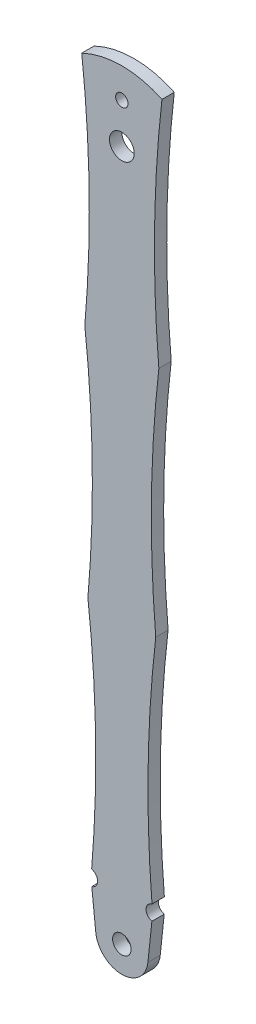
ISO-10303-21;
HEADER;
FILE_DESCRIPTION(('STEP AP214'),'2;1');
FILE_NAME('part.step','',(''),(''),'','','');
FILE_SCHEMA(('AUTOMOTIVE_DESIGN { 1 0 10303 214 1 1 1 1 }'));
ENDSEC;
DATA;
#1=APPLICATION_CONTEXT('core data for automotive mechanical design processes');
#2=APPLICATION_PROTOCOL_DEFINITION('international standard','automotive_design',2000,#1);
#3=PRODUCT_CONTEXT('',#1,'mechanical');
#4=PRODUCT('Part','Part','',(#3));
#5=PRODUCT_RELATED_PRODUCT_CATEGORY('part','',(#4));
#6=PRODUCT_DEFINITION_FORMATION('','',#4);
#7=PRODUCT_DEFINITION_CONTEXT('part definition',#1,'design');
#8=PRODUCT_DEFINITION('design','',#6,#7);
#9=PRODUCT_DEFINITION_SHAPE('','',#8);
#10=(LENGTH_UNIT() NAMED_UNIT(*) SI_UNIT(.MILLI.,.METRE.));
#11=(NAMED_UNIT(*) PLANE_ANGLE_UNIT() SI_UNIT($,.RADIAN.));
#12=(NAMED_UNIT(*) SI_UNIT($,.STERADIAN.) SOLID_ANGLE_UNIT());
#13=UNCERTAINTY_MEASURE_WITH_UNIT(LENGTH_MEASURE(1.E-05),#10,'distance_accuracy_value','');
#14=(GEOMETRIC_REPRESENTATION_CONTEXT(3) GLOBAL_UNCERTAINTY_ASSIGNED_CONTEXT((#13)) GLOBAL_UNIT_ASSIGNED_CONTEXT((#10,
#11,#12)) REPRESENTATION_CONTEXT('',''));
#15=CARTESIAN_POINT('',(0.,0.,0.));
#16=DIRECTION('',(0.,0.,1.));
#17=DIRECTION('',(1.,0.,0.));
#18=AXIS2_PLACEMENT_3D('',#15,#16,#17);
#19=CARTESIAN_POINT('',(-10.8900369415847,111.423525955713,2.));
#20=DIRECTION('',(0.,0.,-1.));
#21=DIRECTION('',(-1.,0.,0.));
#22=AXIS2_PLACEMENT_3D('',#19,#20,#21);
#23=CYLINDRICAL_SURFACE('',#22,15.);
#24=CARTESIAN_POINT('',(-10.8900369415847,111.423525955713,0.));
#25=DIRECTION('',(0.,0.,1.));
#26=DIRECTION('',(1.,0.,0.));
#27=AXIS2_PLACEMENT_3D('',#24,#25,#26);
#28=CIRCLE('',#27,15.);
#29=CARTESIAN_POINT('',(-4.39003694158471,124.942031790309,0.));
#30=VERTEX_POINT('',#29);
#31=CARTESIAN_POINT('',(-17.3900369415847,124.942031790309,0.));
#32=VERTEX_POINT('',#31);
#33=EDGE_CURVE('E191',#30,#32,#28,.T.);
#34=ORIENTED_EDGE('',*,*,#33,.T.);
#35=DIRECTION('',(0.,0.,-1.));
#36=VECTOR('',#35,1.);
#37=CARTESIAN_POINT('',(-17.3900369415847,124.942031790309,2.));
#38=LINE('',#37,#36);
#39=CARTESIAN_POINT('',(-17.3900369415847,124.942031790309,2.));
#40=VERTEX_POINT('',#39);
#41=EDGE_CURVE('E46',#40,#32,#38,.T.);
#42=ORIENTED_EDGE('',*,*,#41,.F.);
#43=CARTESIAN_POINT('',(-10.8900369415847,111.423525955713,2.));
#44=DIRECTION('',(0.,0.,1.));
#45=DIRECTION('',(1.,0.,0.));
#46=AXIS2_PLACEMENT_3D('',#43,#44,#45);
#47=CIRCLE('',#46,15.);
#48=CARTESIAN_POINT('',(-4.39003694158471,124.942031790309,2.));
#49=VERTEX_POINT('',#48);
#50=EDGE_CURVE('E160',#49,#40,#47,.T.);
#51=ORIENTED_EDGE('',*,*,#50,.F.);
#52=DIRECTION('',(0.,0.,-1.));
#53=VECTOR('',#52,1.);
#54=CARTESIAN_POINT('',(-4.39003694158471,124.942031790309,2.));
#55=LINE('',#54,#53);
#56=EDGE_CURVE('E161',#49,#30,#55,.T.);
#57=ORIENTED_EDGE('',*,*,#56,.T.);
#58=EDGE_LOOP('',(#34,#42,#51,#57));
#59=FACE_BOUND('',#58,.T.);
#60=ADVANCED_FACE('F39',(#59),#23,.T.);
#61=CARTESIAN_POINT('',(-206.171121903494,103.454780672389,2.));
#62=DIRECTION('',(0.,0.,-1.));
#63=DIRECTION('',(-1.,0.,0.));
#64=AXIS2_PLACEMENT_3D('',#61,#62,#63);
#65=CYLINDRICAL_SURFACE('',#64,190.);
#66=CARTESIAN_POINT('',(-206.171121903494,103.454780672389,0.));
#67=DIRECTION('',(0.,0.,1.));
#68=DIRECTION('',(1.,0.,0.));
#69=AXIS2_PLACEMENT_3D('',#66,#67,#68);
#70=CIRCLE('',#69,190.);
#71=CARTESIAN_POINT('',(-16.8900369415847,86.9420317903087,0.));
#72=VERTEX_POINT('',#71);
#73=EDGE_CURVE('E185',#32,#72,#70,.F.);
#74=ORIENTED_EDGE('',*,*,#73,.T.);
#75=DIRECTION('',(0.,0.,-1.));
#76=VECTOR('',#75,1.);
#77=CARTESIAN_POINT('',(-16.8900369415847,86.9420317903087,2.));
#78=LINE('',#77,#76);
#79=CARTESIAN_POINT('',(-16.8900369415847,86.9420317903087,2.));
#80=VERTEX_POINT('',#79);
#81=EDGE_CURVE('E177',#80,#72,#78,.T.);
#82=ORIENTED_EDGE('',*,*,#81,.F.);
#83=CARTESIAN_POINT('',(-206.171121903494,103.454780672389,2.));
#84=DIRECTION('',(0.,0.,1.));
#85=DIRECTION('',(1.,0.,0.));
#86=AXIS2_PLACEMENT_3D('',#83,#84,#85);
#87=CIRCLE('',#86,190.);
#88=EDGE_CURVE('E186',#40,#80,#87,.F.);
#89=ORIENTED_EDGE('',*,*,#88,.F.);
#90=ORIENTED_EDGE('',*,*,#41,.T.);
#91=EDGE_LOOP('',(#74,#82,#89,#90));
#92=FACE_BOUND('',#91,.T.);
#93=ADVANCED_FACE('F183',(#92),#65,.F.);
#94=CARTESIAN_POINT('',(-205.671121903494,65.4547806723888,2.));
#95=DIRECTION('',(0.,0.,-1.));
#96=DIRECTION('',(-1.,0.,0.));
#97=AXIS2_PLACEMENT_3D('',#94,#95,#96);
#98=CYLINDRICAL_SURFACE('',#97,190.);
#99=CARTESIAN_POINT('',(-205.671121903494,65.4547806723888,0.));
#100=DIRECTION('',(0.,0.,1.));
#101=DIRECTION('',(1.,0.,0.));
#102=AXIS2_PLACEMENT_3D('',#99,#100,#101);
#103=CIRCLE('',#102,190.);
#104=CARTESIAN_POINT('',(-16.3900369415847,48.9420317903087,0.));
#105=VERTEX_POINT('',#104);
#106=EDGE_CURVE('E194',#72,#105,#103,.F.);
#107=ORIENTED_EDGE('',*,*,#106,.T.);
#108=DIRECTION('',(0.,0.,-1.));
#109=VECTOR('',#108,1.);
#110=CARTESIAN_POINT('',(-16.3900369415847,48.9420317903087,2.));
#111=LINE('',#110,#109);
#112=CARTESIAN_POINT('',(-16.3900369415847,48.9420317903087,2.));
#113=VERTEX_POINT('',#112);
#114=EDGE_CURVE('E174',#113,#105,#111,.T.);
#115=ORIENTED_EDGE('',*,*,#114,.F.);
#116=CARTESIAN_POINT('',(-205.671121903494,65.4547806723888,2.));
#117=DIRECTION('',(0.,0.,1.));
#118=DIRECTION('',(1.,0.,0.));
#119=AXIS2_PLACEMENT_3D('',#116,#117,#118);
#120=CIRCLE('',#119,190.);
#121=EDGE_CURVE('E303',#80,#113,#120,.F.);
#122=ORIENTED_EDGE('',*,*,#121,.F.);
#123=ORIENTED_EDGE('',*,*,#81,.T.);
#124=EDGE_LOOP('',(#107,#115,#122,#123));
#125=FACE_BOUND('',#124,.T.);
#126=ADVANCED_FACE('F263',(#125),#98,.F.);
#127=CARTESIAN_POINT('',(-205.121034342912,27.0191984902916,2.));
#128=DIRECTION('',(0.,0.,-1.));
#129=DIRECTION('',(-1.,0.,0.));
#130=AXIS2_PLACEMENT_3D('',#127,#128,#129);
#131=CYLINDRICAL_SURFACE('',#130,190.);
#132=CARTESIAN_POINT('',(-205.121034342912,27.0191984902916,0.));
#133=DIRECTION('',(0.,0.,1.));
#134=DIRECTION('',(1.,0.,0.));
#135=AXIS2_PLACEMENT_3D('',#132,#133,#134);
#136=CIRCLE('',#135,190.);
#137=CARTESIAN_POINT('',(-15.7829406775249,11.1734960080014,0.));
#138=VERTEX_POINT('',#137);
#139=EDGE_CURVE('E202',#105,#138,#136,.F.);
#140=ORIENTED_EDGE('',*,*,#139,.T.);
#141=DIRECTION('',(0.,0.,1.));
#142=VECTOR('',#141,1.);
#143=CARTESIAN_POINT('',(-15.7829406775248,11.1734960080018,1.));
#144=LINE('',#143,#142);
#145=CARTESIAN_POINT('',(-15.7829406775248,11.1734960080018,2.));
#146=VERTEX_POINT('',#145);
#147=EDGE_CURVE('E61',#138,#146,#144,.T.);
#148=ORIENTED_EDGE('',*,*,#147,.T.);
#149=CARTESIAN_POINT('',(-205.121034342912,27.0191984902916,2.));
#150=DIRECTION('',(0.,0.,1.));
#151=DIRECTION('',(1.,0.,0.));
#152=AXIS2_PLACEMENT_3D('',#149,#150,#151);
#153=CIRCLE('',#152,190.);
#154=EDGE_CURVE('E228',#113,#146,#153,.F.);
#155=ORIENTED_EDGE('',*,*,#154,.F.);
#156=ORIENTED_EDGE('',*,*,#114,.T.);
#157=EDGE_LOOP('',(#140,#148,#155,#156));
#158=FACE_BOUND('',#157,.T.);
#159=ADVANCED_FACE('F267',(#158),#131,.F.);
#160=CARTESIAN_POINT('',(-14.6720017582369,-1.554473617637,2.));
#161=DIRECTION('',(0.994434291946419,0.105358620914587,0.));
#162=DIRECTION('',(-0.105358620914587,0.99443429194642,0.));
#163=AXIS2_PLACEMENT_3D('',#160,#161,#162);
#164=PLANE('',#163);
#165=DIRECTION('',(0.105358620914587,-0.99443429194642,0.));
#166=VECTOR('',#165,1.);
#167=CARTESIAN_POINT('',(-14.6720017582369,-1.554473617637,2.));
#168=LINE('',#167,#166);
#169=CARTESIAN_POINT('',(-15.7630093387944,8.74307338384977,2.));
#170=VERTEX_POINT('',#169);
#171=CARTESIAN_POINT('',(-15.116382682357,2.63984504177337,2.));
#172=VERTEX_POINT('',#171);
#173=EDGE_CURVE('E226',#170,#172,#168,.T.);
#174=ORIENTED_EDGE('',*,*,#173,.F.);
#175=DIRECTION('',(0.,0.,1.));
#176=VECTOR('',#175,1.);
#177=CARTESIAN_POINT('',(-15.7630093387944,8.74307338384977,0.));
#178=LINE('',#177,#176);
#179=CARTESIAN_POINT('',(-15.7630093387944,8.74307338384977,0.));
#180=VERTEX_POINT('',#179);
#181=EDGE_CURVE('E196',#170,#180,#178,.F.);
#182=ORIENTED_EDGE('',*,*,#181,.T.);
#183=DIRECTION('',(0.105358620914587,-0.99443429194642,0.));
#184=VECTOR('',#183,1.);
#185=CARTESIAN_POINT('',(-14.6720017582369,-1.554473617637,0.));
#186=LINE('',#185,#184);
#187=CARTESIAN_POINT('',(-15.116382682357,2.63984504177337,0.));
#188=VERTEX_POINT('',#187);
#189=EDGE_CURVE('E205',#180,#188,#186,.T.);
#190=ORIENTED_EDGE('',*,*,#189,.T.);
#191=DIRECTION('',(0.,0.,-1.));
#192=VECTOR('',#191,1.);
#193=CARTESIAN_POINT('',(-15.116382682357,2.63984504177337,2.));
#194=LINE('',#193,#192);
#195=EDGE_CURVE('E171',#172,#188,#194,.T.);
#196=ORIENTED_EDGE('',*,*,#195,.F.);
#197=EDGE_LOOP('',(#174,#182,#190,#196));
#198=FACE_BOUND('',#197,.T.);
#199=ADVANCED_FACE('F273',(#198),#164,.F.);
#200=CARTESIAN_POINT('',(-10.8900369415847,3.08761918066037,2.));
#201=DIRECTION('',(0.,0.,-1.));
#202=DIRECTION('',(-1.,0.,0.));
#203=AXIS2_PLACEMENT_3D('',#200,#201,#202);
#204=CYLINDRICAL_SURFACE('',#203,4.25);
#205=CARTESIAN_POINT('',(-10.8900369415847,3.08761918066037,0.));
#206=DIRECTION('',(0.,0.,1.));
#207=DIRECTION('',(1.,0.,0.));
#208=AXIS2_PLACEMENT_3D('',#205,#206,#207);
#209=CIRCLE('',#208,4.25);
#210=CARTESIAN_POINT('',(-6.6636912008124,2.63984504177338,0.));
#211=VERTEX_POINT('',#210);
#212=EDGE_CURVE('E152',#188,#211,#209,.T.);
#213=ORIENTED_EDGE('',*,*,#212,.T.);
#214=DIRECTION('',(0.,0.,-1.));
#215=VECTOR('',#214,1.);
#216=CARTESIAN_POINT('',(-6.6636912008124,2.63984504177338,2.));
#217=LINE('',#216,#215);
#218=CARTESIAN_POINT('',(-6.6636912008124,2.63984504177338,2.));
#219=VERTEX_POINT('',#218);
#220=EDGE_CURVE('E168',#219,#211,#217,.T.);
#221=ORIENTED_EDGE('',*,*,#220,.F.);
#222=CARTESIAN_POINT('',(-10.8900369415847,3.08761918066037,2.));
#223=DIRECTION('',(0.,0.,1.));
#224=DIRECTION('',(1.,0.,0.));
#225=AXIS2_PLACEMENT_3D('',#222,#223,#224);
#226=CIRCLE('',#225,4.25);
#227=EDGE_CURVE('E220',#172,#219,#226,.T.);
#228=ORIENTED_EDGE('',*,*,#227,.F.);
#229=ORIENTED_EDGE('',*,*,#195,.T.);
#230=EDGE_LOOP('',(#213,#221,#228,#229));
#231=FACE_BOUND('',#230,.T.);
#232=ADVANCED_FACE('F210',(#231),#204,.T.);
#233=CARTESIAN_POINT('',(-6.86630374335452,0.72747319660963,2.));
#234=DIRECTION('',(0.994434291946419,-0.105358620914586,0.));
#235=DIRECTION('',(0.105358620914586,0.99443429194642,0.));
#236=AXIS2_PLACEMENT_3D('',#233,#234,#235);
#237=PLANE('',#236);
#238=DIRECTION('',(0.,0.,1.));
#239=VECTOR('',#238,1.);
#240=CARTESIAN_POINT('',(-6.01706454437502,8.74307338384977,0.));
#241=LINE('',#240,#239);
#242=CARTESIAN_POINT('',(-6.01706454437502,8.74307338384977,2.));
#243=VERTEX_POINT('',#242);
#244=CARTESIAN_POINT('',(-6.01706454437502,8.74307338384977,0.));
#245=VERTEX_POINT('',#244);
#246=EDGE_CURVE('E53',#243,#245,#241,.F.);
#247=ORIENTED_EDGE('',*,*,#246,.F.);
#248=DIRECTION('',(-0.105358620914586,-0.99443429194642,0.));
#249=VECTOR('',#248,1.);
#250=CARTESIAN_POINT('',(-6.86630374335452,0.72747319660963,2.));
#251=LINE('',#250,#249);
#252=EDGE_CURVE('E217',#243,#219,#251,.T.);
#253=ORIENTED_EDGE('',*,*,#252,.T.);
#254=ORIENTED_EDGE('',*,*,#220,.T.);
#255=DIRECTION('',(-0.105358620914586,-0.99443429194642,0.));
#256=VECTOR('',#255,1.);
#257=CARTESIAN_POINT('',(-6.86630374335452,0.72747319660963,0.));
#258=LINE('',#257,#256);
#259=EDGE_CURVE('E148',#245,#211,#258,.T.);
#260=ORIENTED_EDGE('',*,*,#259,.F.);
#261=EDGE_LOOP('',(#247,#253,#254,#260));
#262=FACE_BOUND('',#261,.T.);
#263=ADVANCED_FACE('F215',(#262),#237,.T.);
#264=CARTESIAN_POINT('',(183.340960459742,27.0191984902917,2.));
#265=DIRECTION('',(0.,0.,-1.));
#266=DIRECTION('',(-1.,0.,0.));
#267=AXIS2_PLACEMENT_3D('',#264,#265,#266);
#268=CYLINDRICAL_SURFACE('',#267,190.);
#269=DIRECTION('',(0.,0.,1.));
#270=VECTOR('',#269,1.);
#271=CARTESIAN_POINT('',(-5.99713320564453,11.1734960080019,1.));
#272=LINE('',#271,#270);
#273=CARTESIAN_POINT('',(-5.99713320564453,11.1734960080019,0.));
#274=VERTEX_POINT('',#273);
#275=CARTESIAN_POINT('',(-5.99713320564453,11.1734960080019,2.));
#276=VERTEX_POINT('',#275);
#277=EDGE_CURVE('E126',#274,#276,#272,.T.);
#278=ORIENTED_EDGE('',*,*,#277,.F.);
#279=CARTESIAN_POINT('',(183.340960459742,27.0191984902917,0.));
#280=DIRECTION('',(0.,0.,1.));
#281=DIRECTION('',(1.,0.,0.));
#282=AXIS2_PLACEMENT_3D('',#279,#280,#281);
#283=CIRCLE('',#282,190.);
#284=CARTESIAN_POINT('',(-5.3900369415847,48.9420317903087,0.));
#285=VERTEX_POINT('',#284);
#286=EDGE_CURVE('E138',#285,#274,#283,.T.);
#287=ORIENTED_EDGE('',*,*,#286,.F.);
#288=DIRECTION('',(0.,0.,-1.));
#289=VECTOR('',#288,1.);
#290=CARTESIAN_POINT('',(-5.3900369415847,48.9420317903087,2.));
#291=LINE('',#290,#289);
#292=CARTESIAN_POINT('',(-5.3900369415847,48.9420317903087,2.));
#293=VERTEX_POINT('',#292);
#294=EDGE_CURVE('E166',#293,#285,#291,.T.);
#295=ORIENTED_EDGE('',*,*,#294,.F.);
#296=CARTESIAN_POINT('',(183.340960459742,27.0191984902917,2.));
#297=DIRECTION('',(0.,0.,1.));
#298=DIRECTION('',(1.,0.,0.));
#299=AXIS2_PLACEMENT_3D('',#296,#297,#298);
#300=CIRCLE('',#299,190.);
#301=EDGE_CURVE('E141',#293,#276,#300,.T.);
#302=ORIENTED_EDGE('',*,*,#301,.T.);
#303=EDGE_LOOP('',(#278,#287,#295,#302));
#304=FACE_BOUND('',#303,.T.);
#305=ADVANCED_FACE('F137',(#304),#268,.F.);
#306=CARTESIAN_POINT('',(183.891048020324,65.4547806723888,2.));
#307=DIRECTION('',(0.,0.,-1.));
#308=DIRECTION('',(-1.,0.,0.));
#309=AXIS2_PLACEMENT_3D('',#306,#307,#308);
#310=CYLINDRICAL_SURFACE('',#309,190.);
#311=CARTESIAN_POINT('',(183.891048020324,65.4547806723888,0.));
#312=DIRECTION('',(0.,0.,1.));
#313=DIRECTION('',(1.,0.,0.));
#314=AXIS2_PLACEMENT_3D('',#311,#312,#313);
#315=CIRCLE('',#314,190.);
#316=CARTESIAN_POINT('',(-4.89003694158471,86.9420317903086,0.));
#317=VERTEX_POINT('',#316);
#318=EDGE_CURVE('E147',#317,#285,#315,.T.);
#319=ORIENTED_EDGE('',*,*,#318,.F.);
#320=DIRECTION('',(0.,0.,-1.));
#321=VECTOR('',#320,1.);
#322=CARTESIAN_POINT('',(-4.89003694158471,86.9420317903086,2.));
#323=LINE('',#322,#321);
#324=CARTESIAN_POINT('',(-4.89003694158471,86.9420317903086,2.));
#325=VERTEX_POINT('',#324);
#326=EDGE_CURVE('E163',#325,#317,#323,.T.);
#327=ORIENTED_EDGE('',*,*,#326,.F.);
#328=CARTESIAN_POINT('',(183.891048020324,65.4547806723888,2.));
#329=DIRECTION('',(0.,0.,1.));
#330=DIRECTION('',(1.,0.,0.));
#331=AXIS2_PLACEMENT_3D('',#328,#329,#330);
#332=CIRCLE('',#331,190.);
#333=EDGE_CURVE('E233',#325,#293,#332,.T.);
#334=ORIENTED_EDGE('',*,*,#333,.T.);
#335=ORIENTED_EDGE('',*,*,#294,.T.);
#336=EDGE_LOOP('',(#319,#327,#334,#335));
#337=FACE_BOUND('',#336,.T.);
#338=ADVANCED_FACE('F284',(#337),#310,.F.);
#339=CARTESIAN_POINT('',(184.391048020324,103.454780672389,2.));
#340=DIRECTION('',(0.,0.,-1.));
#341=DIRECTION('',(-1.,0.,0.));
#342=AXIS2_PLACEMENT_3D('',#339,#340,#341);
#343=CYLINDRICAL_SURFACE('',#342,190.);
#344=CARTESIAN_POINT('',(184.391048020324,103.454780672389,0.));
#345=DIRECTION('',(0.,0.,1.));
#346=DIRECTION('',(1.,0.,0.));
#347=AXIS2_PLACEMENT_3D('',#344,#345,#346);
#348=CIRCLE('',#347,190.);
#349=EDGE_CURVE('E150',#30,#317,#348,.T.);
#350=ORIENTED_EDGE('',*,*,#349,.F.);
#351=ORIENTED_EDGE('',*,*,#56,.F.);
#352=CARTESIAN_POINT('',(184.391048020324,103.454780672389,2.));
#353=DIRECTION('',(0.,0.,1.));
#354=DIRECTION('',(1.,0.,0.));
#355=AXIS2_PLACEMENT_3D('',#352,#353,#354);
#356=CIRCLE('',#355,190.);
#357=EDGE_CURVE('E235',#49,#325,#356,.T.);
#358=ORIENTED_EDGE('',*,*,#357,.T.);
#359=ORIENTED_EDGE('',*,*,#326,.T.);
#360=EDGE_LOOP('',(#350,#351,#358,#359));
#361=FACE_BOUND('',#360,.T.);
#362=ADVANCED_FACE('F254',(#361),#343,.F.);
#363=CARTESIAN_POINT('',(-10.8900369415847,3.08761918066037,2.));
#364=DIRECTION('',(0.,0.,-1.));
#365=DIRECTION('',(-1.,0.,0.));
#366=AXIS2_PLACEMENT_3D('',#363,#364,#365);
#367=CYLINDRICAL_SURFACE('',#366,1.5);
#368=CARTESIAN_POINT('',(-10.8900369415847,3.08761918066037,2.));
#369=DIRECTION('',(0.,0.,1.));
#370=DIRECTION('',(1.,0.,0.));
#371=AXIS2_PLACEMENT_3D('',#368,#369,#370);
#372=CIRCLE('',#371,1.5);
#373=CARTESIAN_POINT('',(-9.39003694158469,3.08761918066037,2.));
#374=VERTEX_POINT('',#373);
#375=EDGE_CURVE('E164',#374,#374,#372,.T.);
#376=ORIENTED_EDGE('',*,*,#375,.T.);
#377=EDGE_LOOP('',(#376));
#378=FACE_BOUND('',#377,.T.);
#379=CARTESIAN_POINT('',(-10.8900369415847,3.08761918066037,0.));
#380=DIRECTION('',(0.,0.,1.));
#381=DIRECTION('',(1.,0.,0.));
#382=AXIS2_PLACEMENT_3D('',#379,#380,#381);
#383=CIRCLE('',#382,1.5);
#384=CARTESIAN_POINT('',(-9.39003694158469,3.08761918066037,0.));
#385=VERTEX_POINT('',#384);
#386=EDGE_CURVE('E157',#385,#385,#383,.T.);
#387=ORIENTED_EDGE('',*,*,#386,.F.);
#388=EDGE_LOOP('',(#387));
#389=FACE_BOUND('',#388,.T.);
#390=ADVANCED_FACE('F242',(#378,#389),#367,.F.);
#391=CARTESIAN_POINT('',(0.,0.,2.));
#392=DIRECTION('',(0.,0.,1.));
#393=DIRECTION('',(1.,0.,0.));
#394=AXIS2_PLACEMENT_3D('',#391,#392,#393);
#395=PLANE('',#394);
#396=CARTESIAN_POINT('',(-10.8900369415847,121.58761918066,2.));
#397=DIRECTION('',(0.,0.,1.));
#398=DIRECTION('',(1.,0.,0.));
#399=AXIS2_PLACEMENT_3D('',#396,#397,#398);
#400=CIRCLE('',#399,1.);
#401=CARTESIAN_POINT('',(-9.89003694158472,121.58761918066,2.));
#402=VERTEX_POINT('',#401);
#403=EDGE_CURVE('E330',#402,#402,#400,.T.);
#404=ORIENTED_EDGE('',*,*,#403,.F.);
#405=EDGE_LOOP('',(#404));
#406=FACE_BOUND('',#405,.T.);
#407=CARTESIAN_POINT('',(-10.8900369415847,115.08761918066,2.));
#408=DIRECTION('',(0.,0.,1.));
#409=DIRECTION('',(1.,0.,0.));
#410=AXIS2_PLACEMENT_3D('',#407,#408,#409);
#411=CIRCLE('',#410,2.);
#412=CARTESIAN_POINT('',(-8.89003694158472,115.08761918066,2.));
#413=VERTEX_POINT('',#412);
#414=EDGE_CURVE('E332',#413,#413,#411,.T.);
#415=ORIENTED_EDGE('',*,*,#414,.F.);
#416=EDGE_LOOP('',(#415));
#417=FACE_BOUND('',#416,.T.);
#418=CARTESIAN_POINT('',(-5.71442774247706,9.95588456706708,2.));
#419=DIRECTION('',(0.,0.,1.));
#420=DIRECTION('',(1.,0.,0.));
#421=AXIS2_PLACEMENT_3D('',#418,#419,#420);
#422=CIRCLE('',#421,1.25);
#423=EDGE_CURVE('E131',#276,#243,#422,.T.);
#424=ORIENTED_EDGE('',*,*,#423,.F.);
#425=ORIENTED_EDGE('',*,*,#301,.F.);
#426=ORIENTED_EDGE('',*,*,#333,.F.);
#427=ORIENTED_EDGE('',*,*,#357,.F.);
#428=ORIENTED_EDGE('',*,*,#50,.T.);
#429=ORIENTED_EDGE('',*,*,#88,.T.);
#430=ORIENTED_EDGE('',*,*,#121,.T.);
#431=ORIENTED_EDGE('',*,*,#154,.T.);
#432=CARTESIAN_POINT('',(-16.0656461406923,9.95588456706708,2.));
#433=DIRECTION('',(0.,0.,1.));
#434=DIRECTION('',(1.,0.,0.));
#435=AXIS2_PLACEMENT_3D('',#432,#433,#434);
#436=CIRCLE('',#435,1.25);
#437=EDGE_CURVE('E297',#170,#146,#436,.T.);
#438=ORIENTED_EDGE('',*,*,#437,.F.);
#439=ORIENTED_EDGE('',*,*,#173,.T.);
#440=ORIENTED_EDGE('',*,*,#227,.T.);
#441=ORIENTED_EDGE('',*,*,#252,.F.);
#442=EDGE_LOOP('',(#424,#425,#426,#427,#428,#429,#430,#431,#438,#439,#440,#441));
#443=FACE_BOUND('',#442,.T.);
#444=ORIENTED_EDGE('',*,*,#375,.F.);
#445=EDGE_LOOP('',(#444));
#446=FACE_BOUND('',#445,.T.);
#447=ADVANCED_FACE('F222',(#406,#417,#443,#446),#395,.T.);
#448=CARTESIAN_POINT('',(0.,0.,0.));
#449=DIRECTION('',(0.,0.,1.));
#450=DIRECTION('',(1.,0.,0.));
#451=AXIS2_PLACEMENT_3D('',#448,#449,#450);
#452=PLANE('',#451);
#453=CARTESIAN_POINT('',(-10.8900369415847,121.58761918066,0.));
#454=DIRECTION('',(0.,0.,1.));
#455=DIRECTION('',(1.,0.,0.));
#456=AXIS2_PLACEMENT_3D('',#453,#454,#455);
#457=CIRCLE('',#456,1.);
#458=CARTESIAN_POINT('',(-9.89003694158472,121.58761918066,0.));
#459=VERTEX_POINT('',#458);
#460=EDGE_CURVE('E328',#459,#459,#457,.T.);
#461=ORIENTED_EDGE('',*,*,#460,.T.);
#462=EDGE_LOOP('',(#461));
#463=FACE_BOUND('',#462,.T.);
#464=CARTESIAN_POINT('',(-10.8900369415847,115.08761918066,0.));
#465=DIRECTION('',(0.,0.,1.));
#466=DIRECTION('',(1.,0.,0.));
#467=AXIS2_PLACEMENT_3D('',#464,#465,#466);
#468=CIRCLE('',#467,2.);
#469=CARTESIAN_POINT('',(-8.89003694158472,115.08761918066,0.));
#470=VERTEX_POINT('',#469);
#471=EDGE_CURVE('E132',#470,#470,#468,.F.);
#472=ORIENTED_EDGE('',*,*,#471,.F.);
#473=EDGE_LOOP('',(#472));
#474=FACE_BOUND('',#473,.T.);
#475=ORIENTED_EDGE('',*,*,#286,.T.);
#476=CARTESIAN_POINT('',(-5.71442774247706,9.95588456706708,0.));
#477=DIRECTION('',(0.,0.,1.));
#478=DIRECTION('',(1.,0.,0.));
#479=AXIS2_PLACEMENT_3D('',#476,#477,#478);
#480=CIRCLE('',#479,1.25);
#481=EDGE_CURVE('E123',#274,#245,#480,.T.);
#482=ORIENTED_EDGE('',*,*,#481,.T.);
#483=ORIENTED_EDGE('',*,*,#259,.T.);
#484=ORIENTED_EDGE('',*,*,#212,.F.);
#485=ORIENTED_EDGE('',*,*,#189,.F.);
#486=CARTESIAN_POINT('',(-16.0656461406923,9.95588456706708,0.));
#487=DIRECTION('',(0.,0.,1.));
#488=DIRECTION('',(1.,0.,0.));
#489=AXIS2_PLACEMENT_3D('',#486,#487,#488);
#490=CIRCLE('',#489,1.25);
#491=EDGE_CURVE('E11',#180,#138,#490,.T.);
#492=ORIENTED_EDGE('',*,*,#491,.T.);
#493=ORIENTED_EDGE('',*,*,#139,.F.);
#494=ORIENTED_EDGE('',*,*,#106,.F.);
#495=ORIENTED_EDGE('',*,*,#73,.F.);
#496=ORIENTED_EDGE('',*,*,#33,.F.);
#497=ORIENTED_EDGE('',*,*,#349,.T.);
#498=ORIENTED_EDGE('',*,*,#318,.T.);
#499=EDGE_LOOP('',(#475,#482,#483,#484,#485,#492,#493,#494,#495,#496,#497,#498));
#500=FACE_BOUND('',#499,.T.);
#501=ORIENTED_EDGE('',*,*,#386,.T.);
#502=EDGE_LOOP('',(#501));
#503=FACE_BOUND('',#502,.T.);
#504=ADVANCED_FACE('F143',(#463,#474,#500,#503),#452,.F.);
#505=CARTESIAN_POINT('',(-16.0656461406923,9.95588456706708,0.));
#506=DIRECTION('',(0.,0.,1.));
#507=DIRECTION('',(1.,0.,0.));
#508=AXIS2_PLACEMENT_3D('',#505,#506,#507);
#509=CYLINDRICAL_SURFACE('',#508,1.25);
#510=ORIENTED_EDGE('',*,*,#491,.F.);
#511=ORIENTED_EDGE('',*,*,#181,.F.);
#512=ORIENTED_EDGE('',*,*,#437,.T.);
#513=ORIENTED_EDGE('',*,*,#147,.F.);
#514=EDGE_LOOP('',(#510,#511,#512,#513));
#515=FACE_BOUND('',#514,.T.);
#516=ADVANCED_FACE('F251',(#515),#509,.F.);
#517=CARTESIAN_POINT('',(-5.71442774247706,9.95588456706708,0.));
#518=DIRECTION('',(0.,0.,1.));
#519=DIRECTION('',(1.,0.,0.));
#520=AXIS2_PLACEMENT_3D('',#517,#518,#519);
#521=CYLINDRICAL_SURFACE('',#520,1.25);
#522=ORIENTED_EDGE('',*,*,#246,.T.);
#523=ORIENTED_EDGE('',*,*,#481,.F.);
#524=ORIENTED_EDGE('',*,*,#277,.T.);
#525=ORIENTED_EDGE('',*,*,#423,.T.);
#526=EDGE_LOOP('',(#522,#523,#524,#525));
#527=FACE_BOUND('',#526,.T.);
#528=ADVANCED_FACE('F125',(#527),#521,.F.);
#529=CARTESIAN_POINT('',(-10.8900369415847,115.08761918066,-0.00100000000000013));
#530=DIRECTION('',(0.,0.,1.));
#531=DIRECTION('',(1.,0.,0.));
#532=AXIS2_PLACEMENT_3D('',#529,#530,#531);
#533=CYLINDRICAL_SURFACE('',#532,2.);
#534=ORIENTED_EDGE('',*,*,#414,.T.);
#535=EDGE_LOOP('',(#534));
#536=FACE_BOUND('',#535,.T.);
#537=ORIENTED_EDGE('',*,*,#471,.T.);
#538=EDGE_LOOP('',(#537));
#539=FACE_BOUND('',#538,.T.);
#540=ADVANCED_FACE('F314',(#536,#539),#533,.F.);
#541=CARTESIAN_POINT('',(-10.8900369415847,121.58761918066,0.));
#542=DIRECTION('',(0.,0.,1.));
#543=DIRECTION('',(1.,0.,0.));
#544=AXIS2_PLACEMENT_3D('',#541,#542,#543);
#545=CYLINDRICAL_SURFACE('',#544,1.);
#546=ORIENTED_EDGE('',*,*,#460,.F.);
#547=EDGE_LOOP('',(#546));
#548=FACE_BOUND('',#547,.T.);
#549=ORIENTED_EDGE('',*,*,#403,.T.);
#550=EDGE_LOOP('',(#549));
#551=FACE_BOUND('',#550,.T.);
#552=ADVANCED_FACE('F319',(#548,#551),#545,.F.);
#553=CLOSED_SHELL('',(#60,#93,#126,#159,#199,#232,#263,#305,#338,#362,#390,#447,#504,#516,#528,
#540,#552));
#554=MANIFOLD_SOLID_BREP('B2',#553);
#555=ADVANCED_BREP_SHAPE_REPRESENTATION('',(#18,#554),#14);
#556=SHAPE_DEFINITION_REPRESENTATION(#9,#555);
ENDSEC;
END-ISO-10303-21;
